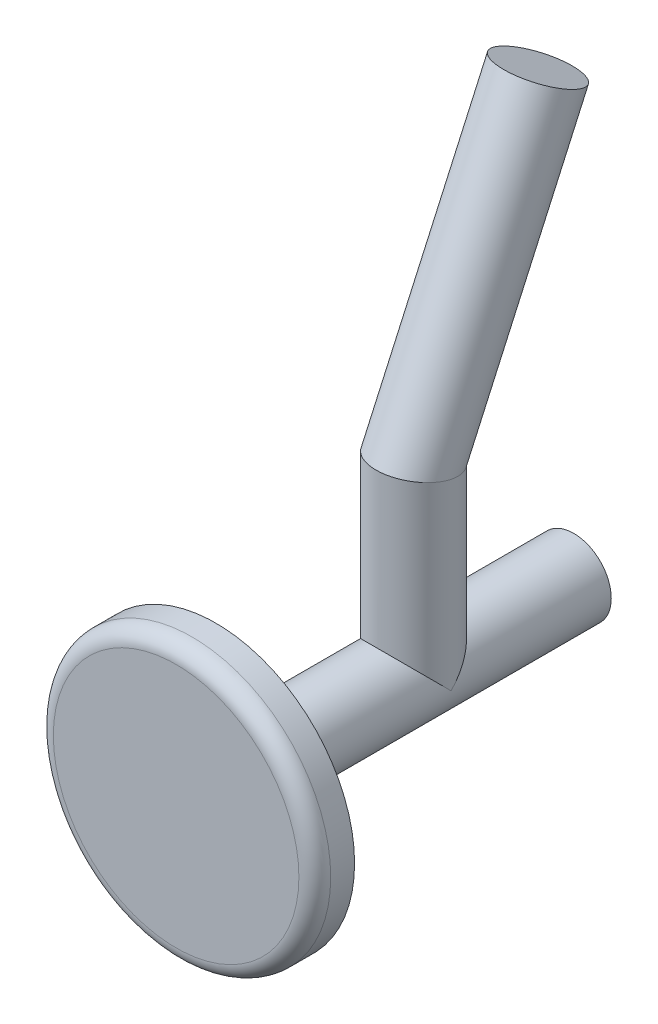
ISO-10303-21;
HEADER;
FILE_DESCRIPTION(('STEP AP214'),'2;1');
FILE_NAME('part.step','',(''),(''),'','','');
FILE_SCHEMA(('AUTOMOTIVE_DESIGN { 1 0 10303 214 1 1 1 1 }'));
ENDSEC;
DATA;
#1=APPLICATION_CONTEXT('core data for automotive mechanical design processes');
#2=APPLICATION_PROTOCOL_DEFINITION('international standard','automotive_design',2000,#1);
#3=PRODUCT_CONTEXT('',#1,'mechanical');
#4=PRODUCT('Part','Part','',(#3));
#5=PRODUCT_RELATED_PRODUCT_CATEGORY('part','',(#4));
#6=PRODUCT_DEFINITION_FORMATION('','',#4);
#7=PRODUCT_DEFINITION_CONTEXT('part definition',#1,'design');
#8=PRODUCT_DEFINITION('design','',#6,#7);
#9=PRODUCT_DEFINITION_SHAPE('','',#8);
#10=(LENGTH_UNIT() NAMED_UNIT(*) SI_UNIT(.MILLI.,.METRE.));
#11=(NAMED_UNIT(*) PLANE_ANGLE_UNIT() SI_UNIT($,.RADIAN.));
#12=(NAMED_UNIT(*) SI_UNIT($,.STERADIAN.) SOLID_ANGLE_UNIT());
#13=UNCERTAINTY_MEASURE_WITH_UNIT(LENGTH_MEASURE(1.E-05),#10,'distance_accuracy_value','');
#14=(GEOMETRIC_REPRESENTATION_CONTEXT(3) GLOBAL_UNCERTAINTY_ASSIGNED_CONTEXT((#13)) GLOBAL_UNIT_ASSIGNED_CONTEXT((#10,
#11,#12)) REPRESENTATION_CONTEXT('',''));
#15=CARTESIAN_POINT('',(0.,0.,0.));
#16=DIRECTION('',(0.,0.,1.));
#17=DIRECTION('',(1.,0.,0.));
#18=AXIS2_PLACEMENT_3D('',#15,#16,#17);
#19=CARTESIAN_POINT('',(0.,0.,250.));
#20=DIRECTION('',(0.,0.,-1.));
#21=DIRECTION('',(-1.,0.,0.));
#22=AXIS2_PLACEMENT_3D('',#19,#20,#21);
#23=CYLINDRICAL_SURFACE('',#22,4.71598453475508);
#24=CARTESIAN_POINT('',(0.,0.,245.));
#25=DIRECTION('',(0.,0.,1.));
#26=DIRECTION('',(1.,0.,0.));
#27=AXIS2_PLACEMENT_3D('',#24,#25,#26);
#28=CIRCLE('',#27,4.71598453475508);
#29=CARTESIAN_POINT('',(4.71598453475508,0.,245.));
#30=VERTEX_POINT('',#29);
#31=EDGE_CURVE('E59',#30,#30,#28,.T.);
#32=ORIENTED_EDGE('',*,*,#31,.F.);
#33=EDGE_LOOP('',(#32));
#34=FACE_BOUND('',#33,.T.);
#35=CARTESIAN_POINT('',(0.,0.,200.));
#36=DIRECTION('',(0.,0.,1.));
#37=DIRECTION('',(1.,0.,0.));
#38=AXIS2_PLACEMENT_3D('',#35,#36,#37);
#39=CIRCLE('',#38,4.71598453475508);
#40=CARTESIAN_POINT('',(4.71598453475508,0.,200.));
#41=VERTEX_POINT('',#40);
#42=EDGE_CURVE('E71',#41,#41,#39,.T.);
#43=ORIENTED_EDGE('',*,*,#42,.T.);
#44=EDGE_LOOP('',(#43));
#45=FACE_BOUND('',#44,.T.);
#46=CARTESIAN_POINT('',(0.,0.,220.147357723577));
#47=DIRECTION('',(0.,-0.707106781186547,-0.707106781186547));
#48=DIRECTION('',(0.,0.707106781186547,-0.707106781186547));
#49=AXIS2_PLACEMENT_3D('',#46,#47,#48);
#50=ELLIPSE('',#49,6.6694092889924,4.71598453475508);
#51=CARTESIAN_POINT('',(4.71598453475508,0.,220.147357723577));
#52=VERTEX_POINT('',#51);
#53=CARTESIAN_POINT('',(-4.71598453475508,0.,220.147357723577));
#54=VERTEX_POINT('',#53);
#55=EDGE_CURVE('E12',#52,#54,#50,.F.);
#56=ORIENTED_EDGE('',*,*,#55,.F.);
#57=CARTESIAN_POINT('',(0.,0.,220.147357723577));
#58=DIRECTION('',(0.,0.707106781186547,-0.707106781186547));
#59=DIRECTION('',(0.,-0.707106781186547,-0.707106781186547));
#60=AXIS2_PLACEMENT_3D('',#57,#58,#59);
#61=ELLIPSE('',#60,6.6694092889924,4.71598453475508);
#62=EDGE_CURVE('E44',#54,#52,#61,.T.);
#63=ORIENTED_EDGE('',*,*,#62,.F.);
#64=EDGE_LOOP('',(#56,#63));
#65=FACE_BOUND('',#64,.T.);
#66=ADVANCED_FACE('F36',(#34,#45,#65),#23,.T.);
#67=CARTESIAN_POINT('',(0.,0.,245.));
#68=DIRECTION('',(0.,0.,1.));
#69=DIRECTION('',(1.,0.,0.));
#70=AXIS2_PLACEMENT_3D('',#67,#68,#69);
#71=PLANE('',#70);
#72=CARTESIAN_POINT('',(0.,0.,245.));
#73=DIRECTION('',(0.,0.,1.));
#74=DIRECTION('',(1.,0.,0.));
#75=AXIS2_PLACEMENT_3D('',#72,#73,#74);
#76=CIRCLE('',#75,17.4399651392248);
#77=CARTESIAN_POINT('',(17.4399651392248,0.,245.));
#78=VERTEX_POINT('',#77);
#79=EDGE_CURVE('E62',#78,#78,#76,.T.);
#80=ORIENTED_EDGE('',*,*,#79,.F.);
#81=EDGE_LOOP('',(#80));
#82=FACE_BOUND('',#81,.T.);
#83=ORIENTED_EDGE('',*,*,#31,.T.);
#84=EDGE_LOOP('',(#83));
#85=FACE_BOUND('',#84,.T.);
#86=ADVANCED_FACE('F87',(#82,#85),#71,.F.);
#87=CARTESIAN_POINT('',(0.,0.,245.));
#88=DIRECTION('',(0.,0.,1.));
#89=DIRECTION('',(1.,0.,0.));
#90=AXIS2_PLACEMENT_3D('',#87,#88,#89);
#91=CYLINDRICAL_SURFACE('',#90,17.4399651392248);
#92=CARTESIAN_POINT('',(0.,0.,248.));
#93=DIRECTION('',(0.,0.,1.));
#94=DIRECTION('',(1.,0.,0.));
#95=AXIS2_PLACEMENT_3D('',#92,#93,#94);
#96=CIRCLE('',#95,17.4399651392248);
#97=CARTESIAN_POINT('',(17.4399651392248,0.,248.));
#98=VERTEX_POINT('',#97);
#99=EDGE_CURVE('E52',#98,#98,#96,.F.);
#100=ORIENTED_EDGE('',*,*,#99,.T.);
#101=EDGE_LOOP('',(#100));
#102=FACE_BOUND('',#101,.T.);
#103=ORIENTED_EDGE('',*,*,#79,.T.);
#104=EDGE_LOOP('',(#103));
#105=FACE_BOUND('',#104,.T.);
#106=ADVANCED_FACE('F92',(#102,#105),#91,.T.);
#107=CARTESIAN_POINT('',(0.,0.,250.));
#108=DIRECTION('',(0.,0.,1.));
#109=DIRECTION('',(1.,0.,0.));
#110=AXIS2_PLACEMENT_3D('',#107,#108,#109);
#111=PLANE('',#110);
#112=CARTESIAN_POINT('',(0.,0.,250.));
#113=DIRECTION('',(0.,0.,1.));
#114=DIRECTION('',(1.,0.,0.));
#115=AXIS2_PLACEMENT_3D('',#112,#113,#114);
#116=CIRCLE('',#115,15.4399651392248);
#117=CARTESIAN_POINT('',(15.4399651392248,0.,250.));
#118=VERTEX_POINT('',#117);
#119=EDGE_CURVE('E54',#118,#118,#116,.T.);
#120=ORIENTED_EDGE('',*,*,#119,.T.);
#121=EDGE_LOOP('',(#120));
#122=FACE_BOUND('',#121,.T.);
#123=ADVANCED_FACE('F97',(#122),#111,.T.);
#124=CARTESIAN_POINT('',(0.,0.,248.));
#125=DIRECTION('',(0.,0.,1.));
#126=DIRECTION('',(1.,0.,0.));
#127=AXIS2_PLACEMENT_3D('',#124,#125,#126);
#128=TOROIDAL_SURFACE('',#127,15.4399651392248,2.);
#129=ORIENTED_EDGE('',*,*,#99,.F.);
#130=EDGE_LOOP('',(#129));
#131=FACE_BOUND('',#130,.T.);
#132=ORIENTED_EDGE('',*,*,#119,.F.);
#133=EDGE_LOOP('',(#132));
#134=FACE_BOUND('',#133,.T.);
#135=ADVANCED_FACE('F38',(#131,#134),#128,.T.);
#136=CARTESIAN_POINT('',(0.,36.3576886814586,220.147357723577));
#137=DIRECTION('',(0.,-1.,0.));
#138=DIRECTION('',(0.,0.,-1.));
#139=AXIS2_PLACEMENT_3D('',#136,#137,#138);
#140=CYLINDRICAL_SURFACE('',#139,4.71598453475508);
#141=CARTESIAN_POINT('',(0.,23.0188701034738,220.147357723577));
#142=DIRECTION('',(0.,0.977591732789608,-0.210509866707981));
#143=DIRECTION('',(0.,-0.210509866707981,-0.977591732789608));
#144=AXIS2_PLACEMENT_3D('',#141,#142,#143);
#145=ELLIPSE('',#144,4.82408389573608,4.71598453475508);
#146=CARTESIAN_POINT('',(0.,22.0033528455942,215.431373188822));
#147=VERTEX_POINT('',#146);
#148=EDGE_CURVE('E68',#147,#147,#145,.T.);
#149=ORIENTED_EDGE('',*,*,#148,.F.);
#150=EDGE_LOOP('',(#149));
#151=FACE_BOUND('',#150,.T.);
#152=ORIENTED_EDGE('',*,*,#62,.T.);
#153=ORIENTED_EDGE('',*,*,#55,.T.);
#154=EDGE_LOOP('',(#152,#153));
#155=FACE_BOUND('',#154,.T.);
#156=ADVANCED_FACE('F51',(#151,#155),#140,.T.);
#157=CARTESIAN_POINT('',(0.,23.0188701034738,220.147357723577));
#158=DIRECTION('',(0.,0.911371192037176,-0.411585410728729));
#159=DIRECTION('',(0.,0.411585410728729,0.911371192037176));
#160=AXIS2_PLACEMENT_3D('',#157,#158,#159);
#161=CYLINDRICAL_SURFACE('',#160,4.71598453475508);
#162=ORIENTED_EDGE('',*,*,#148,.T.);
#163=EDGE_LOOP('',(#162));
#164=FACE_BOUND('',#163,.T.);
#165=CARTESIAN_POINT('',(0.,57.6695134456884,204.498740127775));
#166=DIRECTION('',(0.,0.911371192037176,-0.411585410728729));
#167=DIRECTION('',(0.,0.411585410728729,0.911371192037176));
#168=AXIS2_PLACEMENT_3D('',#165,#166,#167);
#169=CIRCLE('',#168,4.71598453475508);
#170=CARTESIAN_POINT('',(0.,59.6105438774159,208.796752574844));
#171=VERTEX_POINT('',#170);
#172=EDGE_CURVE('E65',#171,#171,#169,.F.);
#173=ORIENTED_EDGE('',*,*,#172,.T.);
#174=EDGE_LOOP('',(#173));
#175=FACE_BOUND('',#174,.T.);
#176=ADVANCED_FACE('F83',(#164,#175),#161,.T.);
#177=CARTESIAN_POINT('',(0.,57.6695134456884,204.498740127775));
#178=DIRECTION('',(0.,0.911371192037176,-0.411585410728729));
#179=DIRECTION('',(0.,0.411585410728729,0.911371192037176));
#180=AXIS2_PLACEMENT_3D('',#177,#178,#179);
#181=PLANE('',#180);
#182=ORIENTED_EDGE('',*,*,#172,.F.);
#183=EDGE_LOOP('',(#182));
#184=FACE_BOUND('',#183,.T.);
#185=ADVANCED_FACE('F78',(#184),#181,.T.);
#186=CARTESIAN_POINT('',(0.,0.,200.));
#187=DIRECTION('',(0.,0.,1.));
#188=DIRECTION('',(1.,0.,0.));
#189=AXIS2_PLACEMENT_3D('',#186,#187,#188);
#190=PLANE('',#189);
#191=ORIENTED_EDGE('',*,*,#42,.F.);
#192=EDGE_LOOP('',(#191));
#193=FACE_BOUND('',#192,.T.);
#194=ADVANCED_FACE('F76',(#193),#190,.F.);
#195=CLOSED_SHELL('',(#66,#86,#106,#123,#135,#156,#176,#185,#194));
#196=MANIFOLD_SOLID_BREP('B2',#195);
#197=ADVANCED_BREP_SHAPE_REPRESENTATION('',(#18,#196),#14);
#198=SHAPE_DEFINITION_REPRESENTATION(#9,#197);
ENDSEC;
END-ISO-10303-21;
